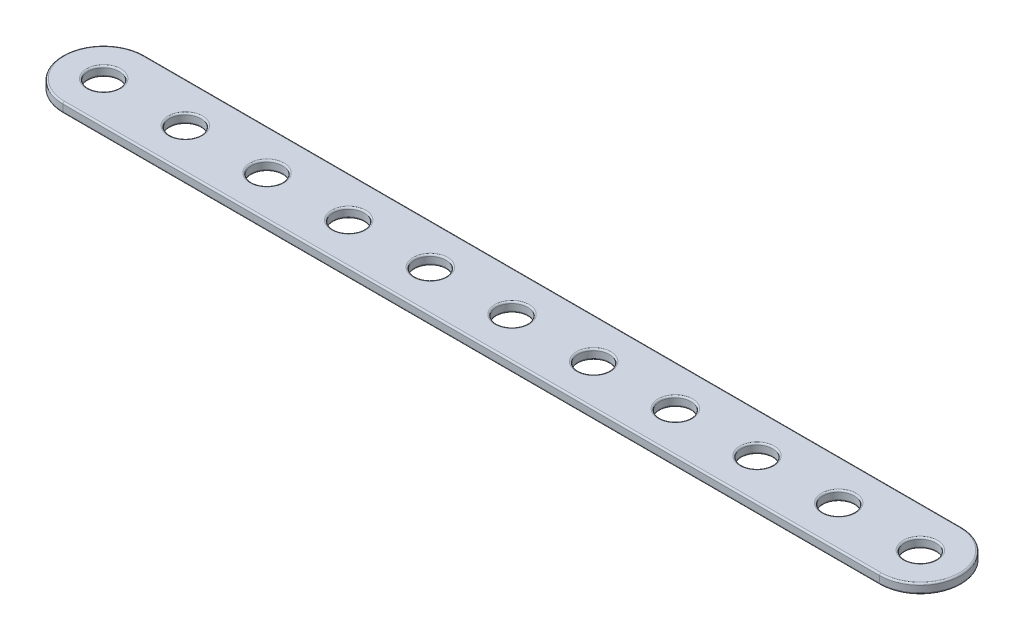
from build123d import *

# Parameters (mm, degrees)
EXTRUDE1_DEPTH     = 1.524
SKETCH2_R          = 2.413
CUT_EXTRUDE1_DEPTH = 134.96206581
LPATTERN1_COUNT    = 11
LPATTERN1_PITCH    = 12.7
FILLET1_R          = 0.254


with BuildPart() as part:
    # Sketch1 → Extrude1 (new body)
    with BuildSketch(Plane(origin=(0, 0, 0), x_dir=(1, 0, 0), z_dir=(0, 1, 0))):
        with BuildLine():
            Line((0, 0), (127, 0))
            ThreePointArc((127, 0), (133.35, 6.35), (127, 12.7))
            Line((127, 12.7), (0, 12.7))
            ThreePointArc((0, 12.7), (-6.35, 6.35), (0, 0))
        make_face()
    extrude(amount=EXTRUDE1_DEPTH)

    # Sketch2 → Cut-Extrude1 (cut, through all)
    with BuildSketch(Plane(origin=(0, 1.524, 0), x_dir=(-1, 0, 0), z_dir=(0, 1, 0))):
        with Locations(Location((0, -6.35, 0), (0, 0, 90))):
            Circle(SKETCH2_R)
    cut_extrude1 = extrude(amount=-CUT_EXTRUDE1_DEPTH, mode=Mode.SUBTRACT)

    # LPattern1: Cut-Extrude1 ×11
    with Locations(*[(i * LPATTERN1_PITCH, 0, 0) for i in range(1, LPATTERN1_COUNT)]):
        add(cut_extrude1, mode=Mode.SUBTRACT)

    # Fillet1
    fillet1_edges = [part.edges().sort_by_distance(p)[0] for p in [
        (133.35, 1.524, -6.35),
        (63.5, 1.524, -12.7),
        (0, 0, -8.763),
        (0, 1.524, -8.763),
        (12.7, 0, -8.763),
        (12.7, 1.524, -8.763),
        (25.4, 0, -8.763),
        (25.4, 1.524, -8.763),
        (38.1, 0, -8.763),
        (38.1, 1.524, -8.763),
        (50.8, 0, -8.763),
        (50.8, 1.524, -8.763),
        (63.5, 0, -8.763),
        (63.5, 1.524, -8.763),
        (76.2, 0, -8.763),
        (76.2, 1.524, -8.763),
        (-6.35, 1.524, -6.35),
        (63.5, 0, -12.7),
        (88.9, 0, -8.763),
        (88.9, 1.524, -8.763),
        (133.35, 0, -6.35),
        (101.6, 0, -8.763),
        (101.6, 1.524, -8.763),
        (63.5, 0, 0),
        (114.3, 0, -8.763),
        (114.3, 1.524, -8.763),
        (127, 0, -8.763),
        (-6.35, 0, -6.35),
        (127, 1.524, -8.763),
        (63.5, 1.524, 0),
    ]]
    fillet(fillet1_edges, radius=FILLET1_R)


solid = part.part
